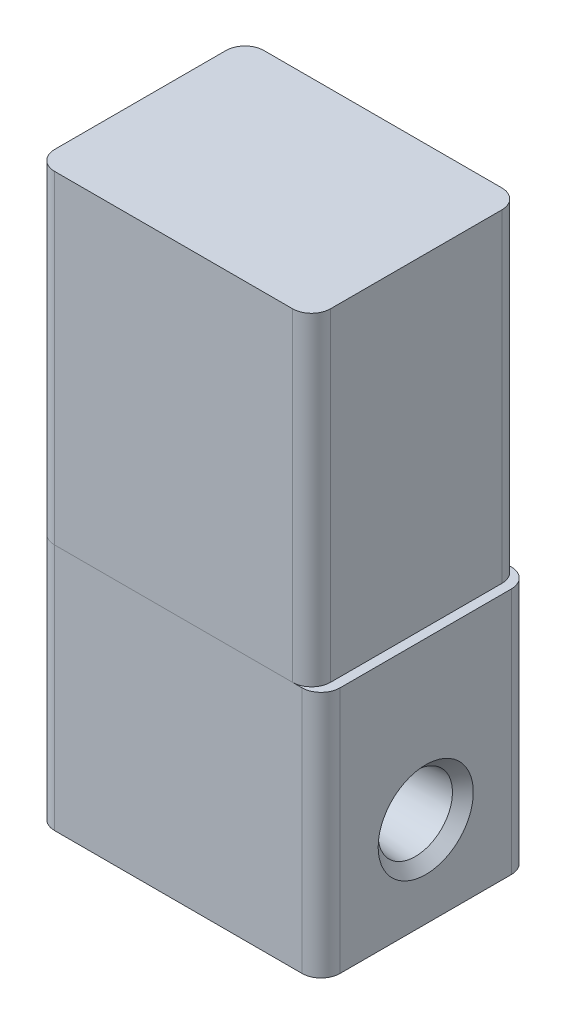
ISO-10303-21;
HEADER;
FILE_DESCRIPTION(('STEP AP214'),'2;1');
FILE_NAME('part.step','',(''),(''),'','','');
FILE_SCHEMA(('AUTOMOTIVE_DESIGN { 1 0 10303 214 1 1 1 1 }'));
ENDSEC;
DATA;
#1=APPLICATION_CONTEXT('core data for automotive mechanical design processes');
#2=APPLICATION_PROTOCOL_DEFINITION('international standard','automotive_design',2000,#1);
#3=PRODUCT_CONTEXT('',#1,'mechanical');
#4=PRODUCT('Part','Part','',(#3));
#5=PRODUCT_RELATED_PRODUCT_CATEGORY('part','',(#4));
#6=PRODUCT_DEFINITION_FORMATION('','',#4);
#7=PRODUCT_DEFINITION_CONTEXT('part definition',#1,'design');
#8=PRODUCT_DEFINITION('design','',#6,#7);
#9=PRODUCT_DEFINITION_SHAPE('','',#8);
#10=(LENGTH_UNIT() NAMED_UNIT(*) SI_UNIT(.MILLI.,.METRE.));
#11=(NAMED_UNIT(*) PLANE_ANGLE_UNIT() SI_UNIT($,.RADIAN.));
#12=(NAMED_UNIT(*) SI_UNIT($,.STERADIAN.) SOLID_ANGLE_UNIT());
#13=UNCERTAINTY_MEASURE_WITH_UNIT(LENGTH_MEASURE(1.E-05),#10,'distance_accuracy_value','');
#14=(GEOMETRIC_REPRESENTATION_CONTEXT(3) GLOBAL_UNCERTAINTY_ASSIGNED_CONTEXT((#13)) GLOBAL_UNIT_ASSIGNED_CONTEXT((#10,
#11,#12)) REPRESENTATION_CONTEXT('',''));
#15=CARTESIAN_POINT('',(0.,0.,0.));
#16=DIRECTION('',(0.,0.,1.));
#17=DIRECTION('',(1.,0.,0.));
#18=AXIS2_PLACEMENT_3D('',#15,#16,#17);
#19=CARTESIAN_POINT('',(-15.,60.,11.));
#20=DIRECTION('',(1.,0.,0.));
#21=DIRECTION('',(0.,0.,-1.));
#22=AXIS2_PLACEMENT_3D('',#19,#20,#21);
#23=PLANE('',#22);
#24=DIRECTION('',(0.,0.,1.));
#25=VECTOR('',#24,1.);
#26=CARTESIAN_POINT('',(-15.,60.,11.));
#27=LINE('',#26,#25);
#28=CARTESIAN_POINT('',(-15.,60.,-9.));
#29=VERTEX_POINT('',#28);
#30=CARTESIAN_POINT('',(-15.,60.,9.));
#31=VERTEX_POINT('',#30);
#32=EDGE_CURVE('E133',#29,#31,#27,.T.);
#33=ORIENTED_EDGE('',*,*,#32,.F.);
#34=DIRECTION('',(0.,-1.,0.));
#35=VECTOR('',#34,1.);
#36=CARTESIAN_POINT('',(-15.,60.,-9.));
#37=LINE('',#36,#35);
#38=CARTESIAN_POINT('',(-15.,26.,-9.));
#39=VERTEX_POINT('',#38);
#40=EDGE_CURVE('E118',#29,#39,#37,.T.);
#41=ORIENTED_EDGE('',*,*,#40,.T.);
#42=DIRECTION('',(0.,0.,1.));
#43=VECTOR('',#42,1.);
#44=CARTESIAN_POINT('',(-15.,26.,11.));
#45=LINE('',#44,#43);
#46=CARTESIAN_POINT('',(-15.,26.,9.));
#47=VERTEX_POINT('',#46);
#48=EDGE_CURVE('E130',#39,#47,#45,.T.);
#49=ORIENTED_EDGE('',*,*,#48,.T.);
#50=DIRECTION('',(0.,-1.,0.));
#51=VECTOR('',#50,1.);
#52=CARTESIAN_POINT('',(-15.,60.,9.));
#53=LINE('',#52,#51);
#54=EDGE_CURVE('E135',#47,#31,#53,.F.);
#55=ORIENTED_EDGE('',*,*,#54,.T.);
#56=EDGE_LOOP('',(#33,#41,#49,#55));
#57=FACE_BOUND('',#56,.T.);
#58=ADVANCED_FACE('F49',(#57),#23,.F.);
#59=CARTESIAN_POINT('',(14.,60.,11.));
#60=DIRECTION('',(0.,0.,-1.));
#61=DIRECTION('',(-1.,0.,0.));
#62=AXIS2_PLACEMENT_3D('',#59,#60,#61);
#63=PLANE('',#62);
#64=DIRECTION('',(1.,0.,0.));
#65=VECTOR('',#64,1.);
#66=CARTESIAN_POINT('',(14.,60.,11.));
#67=LINE('',#66,#65);
#68=CARTESIAN_POINT('',(-13.,60.,11.));
#69=VERTEX_POINT('',#68);
#70=CARTESIAN_POINT('',(12.,60.,11.));
#71=VERTEX_POINT('',#70);
#72=EDGE_CURVE('E184',#69,#71,#67,.T.);
#73=ORIENTED_EDGE('',*,*,#72,.F.);
#74=DIRECTION('',(0.,-1.,0.));
#75=VECTOR('',#74,1.);
#76=CARTESIAN_POINT('',(-13.,60.,11.));
#77=LINE('',#76,#75);
#78=CARTESIAN_POINT('',(-13.,26.,11.));
#79=VERTEX_POINT('',#78);
#80=EDGE_CURVE('E168',#69,#79,#77,.T.);
#81=ORIENTED_EDGE('',*,*,#80,.T.);
#82=DIRECTION('',(1.,0.,0.));
#83=VECTOR('',#82,1.);
#84=CARTESIAN_POINT('',(14.,26.,11.));
#85=LINE('',#84,#83);
#86=CARTESIAN_POINT('',(12.,26.,11.));
#87=VERTEX_POINT('',#86);
#88=EDGE_CURVE('E139',#79,#87,#85,.T.);
#89=ORIENTED_EDGE('',*,*,#88,.T.);
#90=DIRECTION('',(0.,-1.,0.));
#91=VECTOR('',#90,1.);
#92=CARTESIAN_POINT('',(12.,60.,11.));
#93=LINE('',#92,#91);
#94=EDGE_CURVE('E166',#87,#71,#93,.F.);
#95=ORIENTED_EDGE('',*,*,#94,.T.);
#96=EDGE_LOOP('',(#73,#81,#89,#95));
#97=FACE_BOUND('',#96,.T.);
#98=ADVANCED_FACE('F194',(#97),#63,.F.);
#99=CARTESIAN_POINT('',(14.,60.,11.));
#100=DIRECTION('',(-1.,0.,0.));
#101=DIRECTION('',(0.,0.,1.));
#102=AXIS2_PLACEMENT_3D('',#99,#100,#101);
#103=PLANE('',#102);
#104=DIRECTION('',(0.,0.,-1.));
#105=VECTOR('',#104,1.);
#106=CARTESIAN_POINT('',(14.,26.,11.));
#107=LINE('',#106,#105);
#108=CARTESIAN_POINT('',(14.,26.,9.));
#109=VERTEX_POINT('',#108);
#110=CARTESIAN_POINT('',(14.,26.,-9.));
#111=VERTEX_POINT('',#110);
#112=EDGE_CURVE('E142',#109,#111,#107,.T.);
#113=ORIENTED_EDGE('',*,*,#112,.T.);
#114=DIRECTION('',(0.,-1.,0.));
#115=VECTOR('',#114,1.);
#116=CARTESIAN_POINT('',(14.,60.,-9.));
#117=LINE('',#116,#115);
#118=CARTESIAN_POINT('',(14.,60.,-9.));
#119=VERTEX_POINT('',#118);
#120=EDGE_CURVE('E12',#111,#119,#117,.F.);
#121=ORIENTED_EDGE('',*,*,#120,.T.);
#122=DIRECTION('',(0.,0.,-1.));
#123=VECTOR('',#122,1.);
#124=CARTESIAN_POINT('',(14.,60.,11.));
#125=LINE('',#124,#123);
#126=CARTESIAN_POINT('',(14.,60.,9.));
#127=VERTEX_POINT('',#126);
#128=EDGE_CURVE('E174',#127,#119,#125,.T.);
#129=ORIENTED_EDGE('',*,*,#128,.F.);
#130=DIRECTION('',(0.,-1.,0.));
#131=VECTOR('',#130,1.);
#132=CARTESIAN_POINT('',(14.,60.,9.));
#133=LINE('',#132,#131);
#134=EDGE_CURVE('E57',#127,#109,#133,.T.);
#135=ORIENTED_EDGE('',*,*,#134,.T.);
#136=EDGE_LOOP('',(#113,#121,#129,#135));
#137=FACE_BOUND('',#136,.T.);
#138=ADVANCED_FACE('F173',(#137),#103,.F.);
#139=CARTESIAN_POINT('',(14.,60.,-11.));
#140=DIRECTION('',(0.,0.,1.));
#141=DIRECTION('',(1.,0.,0.));
#142=AXIS2_PLACEMENT_3D('',#139,#140,#141);
#143=PLANE('',#142);
#144=DIRECTION('',(-1.,0.,0.));
#145=VECTOR('',#144,1.);
#146=CARTESIAN_POINT('',(14.,26.,-11.));
#147=LINE('',#146,#145);
#148=CARTESIAN_POINT('',(12.,26.,-11.));
#149=VERTEX_POINT('',#148);
#150=CARTESIAN_POINT('',(-13.,26.,-11.));
#151=VERTEX_POINT('',#150);
#152=EDGE_CURVE('E149',#149,#151,#147,.T.);
#153=ORIENTED_EDGE('',*,*,#152,.T.);
#154=DIRECTION('',(0.,-1.,0.));
#155=VECTOR('',#154,1.);
#156=CARTESIAN_POINT('',(-13.,60.,-11.));
#157=LINE('',#156,#155);
#158=CARTESIAN_POINT('',(-13.,60.,-11.));
#159=VERTEX_POINT('',#158);
#160=EDGE_CURVE('E119',#151,#159,#157,.F.);
#161=ORIENTED_EDGE('',*,*,#160,.T.);
#162=DIRECTION('',(-1.,0.,0.));
#163=VECTOR('',#162,1.);
#164=CARTESIAN_POINT('',(14.,60.,-11.));
#165=LINE('',#164,#163);
#166=CARTESIAN_POINT('',(12.,60.,-11.));
#167=VERTEX_POINT('',#166);
#168=EDGE_CURVE('E145',#167,#159,#165,.T.);
#169=ORIENTED_EDGE('',*,*,#168,.F.);
#170=DIRECTION('',(0.,-1.,0.));
#171=VECTOR('',#170,1.);
#172=CARTESIAN_POINT('',(12.,60.,-11.));
#173=LINE('',#172,#171);
#174=EDGE_CURVE('E124',#167,#149,#173,.T.);
#175=ORIENTED_EDGE('',*,*,#174,.T.);
#176=EDGE_LOOP('',(#153,#161,#169,#175));
#177=FACE_BOUND('',#176,.T.);
#178=ADVANCED_FACE('F182',(#177),#143,.F.);
#179=CARTESIAN_POINT('',(0.,60.,0.));
#180=DIRECTION('',(0.,1.,0.));
#181=DIRECTION('',(0.,0.,1.));
#182=AXIS2_PLACEMENT_3D('',#179,#180,#181);
#183=PLANE('',#182);
#184=ORIENTED_EDGE('',*,*,#168,.T.);
#185=CARTESIAN_POINT('',(-13.,60.,-9.));
#186=DIRECTION('',(0.,1.,0.));
#187=DIRECTION('',(0.,0.,1.));
#188=AXIS2_PLACEMENT_3D('',#185,#186,#187);
#189=CIRCLE('',#188,2.);
#190=EDGE_CURVE('E164',#159,#29,#189,.T.);
#191=ORIENTED_EDGE('',*,*,#190,.T.);
#192=ORIENTED_EDGE('',*,*,#32,.T.);
#193=CARTESIAN_POINT('',(-13.,60.,9.));
#194=DIRECTION('',(0.,1.,0.));
#195=DIRECTION('',(0.,0.,1.));
#196=AXIS2_PLACEMENT_3D('',#193,#194,#195);
#197=CIRCLE('',#196,2.);
#198=EDGE_CURVE('E162',#31,#69,#197,.T.);
#199=ORIENTED_EDGE('',*,*,#198,.T.);
#200=ORIENTED_EDGE('',*,*,#72,.T.);
#201=CARTESIAN_POINT('',(12.,60.,9.));
#202=DIRECTION('',(0.,1.,0.));
#203=DIRECTION('',(0.,0.,1.));
#204=AXIS2_PLACEMENT_3D('',#201,#202,#203);
#205=CIRCLE('',#204,2.);
#206=EDGE_CURVE('E69',#71,#127,#205,.T.);
#207=ORIENTED_EDGE('',*,*,#206,.T.);
#208=ORIENTED_EDGE('',*,*,#128,.T.);
#209=CARTESIAN_POINT('',(12.,60.,-9.));
#210=DIRECTION('',(0.,1.,0.));
#211=DIRECTION('',(0.,0.,1.));
#212=AXIS2_PLACEMENT_3D('',#209,#210,#211);
#213=CIRCLE('',#212,2.);
#214=EDGE_CURVE('E160',#119,#167,#213,.T.);
#215=ORIENTED_EDGE('',*,*,#214,.T.);
#216=EDGE_LOOP('',(#184,#191,#192,#199,#200,#207,#208,#215));
#217=FACE_BOUND('',#216,.T.);
#218=ADVANCED_FACE('F188',(#217),#183,.T.);
#219=CARTESIAN_POINT('',(0.,26.,0.));
#220=DIRECTION('',(0.,1.,0.));
#221=DIRECTION('',(0.,0.,1.));
#222=AXIS2_PLACEMENT_3D('',#219,#220,#221);
#223=PLANE('',#222);
#224=ORIENTED_EDGE('',*,*,#48,.F.);
#225=CARTESIAN_POINT('',(-13.,26.,-9.));
#226=DIRECTION('',(0.,1.,0.));
#227=DIRECTION('',(0.,0.,1.));
#228=AXIS2_PLACEMENT_3D('',#225,#226,#227);
#229=CIRCLE('',#228,2.);
#230=EDGE_CURVE('E114',#39,#151,#229,.F.);
#231=ORIENTED_EDGE('',*,*,#230,.T.);
#232=ORIENTED_EDGE('',*,*,#152,.F.);
#233=CARTESIAN_POINT('',(12.,26.,-9.));
#234=DIRECTION('',(0.,1.,0.));
#235=DIRECTION('',(0.,0.,1.));
#236=AXIS2_PLACEMENT_3D('',#233,#234,#235);
#237=CIRCLE('',#236,2.);
#238=EDGE_CURVE('E153',#149,#111,#237,.F.);
#239=ORIENTED_EDGE('',*,*,#238,.T.);
#240=ORIENTED_EDGE('',*,*,#112,.F.);
#241=CARTESIAN_POINT('',(12.,26.,9.));
#242=DIRECTION('',(0.,1.,0.));
#243=DIRECTION('',(0.,0.,1.));
#244=AXIS2_PLACEMENT_3D('',#241,#242,#243);
#245=CIRCLE('',#244,2.);
#246=EDGE_CURVE('E134',#109,#87,#245,.F.);
#247=ORIENTED_EDGE('',*,*,#246,.T.);
#248=ORIENTED_EDGE('',*,*,#88,.F.);
#249=CARTESIAN_POINT('',(-13.,26.,9.));
#250=DIRECTION('',(0.,1.,0.));
#251=DIRECTION('',(0.,0.,1.));
#252=AXIS2_PLACEMENT_3D('',#249,#250,#251);
#253=CIRCLE('',#252,2.);
#254=EDGE_CURVE('E125',#79,#47,#253,.F.);
#255=ORIENTED_EDGE('',*,*,#254,.T.);
#256=EDGE_LOOP('',(#224,#231,#232,#239,#240,#247,#248,#255));
#257=FACE_BOUND('',#256,.T.);
#258=ADVANCED_FACE('F137',(#257),#223,.F.);
#259=CARTESIAN_POINT('',(-13.,60.,-9.));
#260=DIRECTION('',(0.,-1.,0.));
#261=DIRECTION('',(0.,0.,-1.));
#262=AXIS2_PLACEMENT_3D('',#259,#260,#261);
#263=CYLINDRICAL_SURFACE('',#262,2.);
#264=ORIENTED_EDGE('',*,*,#190,.F.);
#265=ORIENTED_EDGE('',*,*,#160,.F.);
#266=ORIENTED_EDGE('',*,*,#230,.F.);
#267=ORIENTED_EDGE('',*,*,#40,.F.);
#268=EDGE_LOOP('',(#264,#265,#266,#267));
#269=FACE_BOUND('',#268,.T.);
#270=ADVANCED_FACE('F117',(#269),#263,.T.);
#271=CARTESIAN_POINT('',(-13.,60.,9.));
#272=DIRECTION('',(0.,-1.,0.));
#273=DIRECTION('',(0.,0.,-1.));
#274=AXIS2_PLACEMENT_3D('',#271,#272,#273);
#275=CYLINDRICAL_SURFACE('',#274,2.);
#276=ORIENTED_EDGE('',*,*,#198,.F.);
#277=ORIENTED_EDGE('',*,*,#54,.F.);
#278=ORIENTED_EDGE('',*,*,#254,.F.);
#279=ORIENTED_EDGE('',*,*,#80,.F.);
#280=EDGE_LOOP('',(#276,#277,#278,#279));
#281=FACE_BOUND('',#280,.T.);
#282=ADVANCED_FACE('F192',(#281),#275,.T.);
#283=CARTESIAN_POINT('',(12.,60.,-9.));
#284=DIRECTION('',(0.,-1.,0.));
#285=DIRECTION('',(0.,0.,-1.));
#286=AXIS2_PLACEMENT_3D('',#283,#284,#285);
#287=CYLINDRICAL_SURFACE('',#286,2.);
#288=ORIENTED_EDGE('',*,*,#214,.F.);
#289=ORIENTED_EDGE('',*,*,#120,.F.);
#290=ORIENTED_EDGE('',*,*,#238,.F.);
#291=ORIENTED_EDGE('',*,*,#174,.F.);
#292=EDGE_LOOP('',(#288,#289,#290,#291));
#293=FACE_BOUND('',#292,.T.);
#294=ADVANCED_FACE('F179',(#293),#287,.T.);
#295=CARTESIAN_POINT('',(12.,60.,9.));
#296=DIRECTION('',(0.,-1.,0.));
#297=DIRECTION('',(0.,0.,-1.));
#298=AXIS2_PLACEMENT_3D('',#295,#296,#297);
#299=CYLINDRICAL_SURFACE('',#298,2.);
#300=ORIENTED_EDGE('',*,*,#206,.F.);
#301=ORIENTED_EDGE('',*,*,#94,.F.);
#302=ORIENTED_EDGE('',*,*,#246,.F.);
#303=ORIENTED_EDGE('',*,*,#134,.F.);
#304=EDGE_LOOP('',(#300,#301,#302,#303));
#305=FACE_BOUND('',#304,.T.);
#306=ADVANCED_FACE('F51',(#305),#299,.T.);
#307=CLOSED_SHELL('',(#58,#98,#138,#178,#218,#258,#270,#282,#294,#306));
#308=MANIFOLD_SOLID_BREP('B2',#307);
#309=CARTESIAN_POINT('',(15.,26.,11.));
#310=DIRECTION('',(-1.,0.,0.));
#311=DIRECTION('',(0.,0.,1.));
#312=AXIS2_PLACEMENT_3D('',#309,#310,#311);
#313=PLANE('',#312);
#314=CARTESIAN_POINT('',(15.,9.5,0.));
#315=DIRECTION('',(-1.,0.,0.));
#316=DIRECTION('',(0.,0.,1.));
#317=AXIS2_PLACEMENT_3D('',#314,#315,#316);
#318=CIRCLE('',#317,5.00000000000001);
#319=CARTESIAN_POINT('',(15.,9.5,5.00000000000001));
#320=VERTEX_POINT('',#319);
#321=EDGE_CURVE('E395',#320,#320,#318,.T.);
#322=ORIENTED_EDGE('',*,*,#321,.T.);
#323=EDGE_LOOP('',(#322));
#324=FACE_BOUND('',#323,.T.);
#325=DIRECTION('',(0.,0.,-1.));
#326=VECTOR('',#325,1.);
#327=CARTESIAN_POINT('',(15.,0.,11.));
#328=LINE('',#327,#326);
#329=CARTESIAN_POINT('',(15.,0.,9.));
#330=VERTEX_POINT('',#329);
#331=CARTESIAN_POINT('',(15.,0.,-9.));
#332=VERTEX_POINT('',#331);
#333=EDGE_CURVE('E372',#330,#332,#328,.T.);
#334=ORIENTED_EDGE('',*,*,#333,.T.);
#335=DIRECTION('',(0.,-1.,0.));
#336=VECTOR('',#335,1.);
#337=CARTESIAN_POINT('',(15.,26.,-9.));
#338=LINE('',#337,#336);
#339=CARTESIAN_POINT('',(15.,26.,-9.));
#340=VERTEX_POINT('',#339);
#341=EDGE_CURVE('E47',#332,#340,#338,.F.);
#342=ORIENTED_EDGE('',*,*,#341,.T.);
#343=DIRECTION('',(0.,0.,-1.));
#344=VECTOR('',#343,1.);
#345=CARTESIAN_POINT('',(15.,26.,11.));
#346=LINE('',#345,#344);
#347=CARTESIAN_POINT('',(15.,26.,9.));
#348=VERTEX_POINT('',#347);
#349=EDGE_CURVE('E370',#348,#340,#346,.T.);
#350=ORIENTED_EDGE('',*,*,#349,.F.);
#351=DIRECTION('',(0.,-1.,0.));
#352=VECTOR('',#351,1.);
#353=CARTESIAN_POINT('',(15.,26.,9.));
#354=LINE('',#353,#352);
#355=EDGE_CURVE('E284',#348,#330,#354,.T.);
#356=ORIENTED_EDGE('',*,*,#355,.T.);
#357=EDGE_LOOP('',(#334,#342,#350,#356));
#358=FACE_BOUND('',#357,.T.);
#359=ADVANCED_FACE('F276',(#324,#358),#313,.F.);
#360=CARTESIAN_POINT('',(-15.,26.,-11.));
#361=DIRECTION('',(0.,0.,1.));
#362=DIRECTION('',(1.,0.,0.));
#363=AXIS2_PLACEMENT_3D('',#360,#361,#362);
#364=PLANE('',#363);
#365=DIRECTION('',(-1.,0.,0.));
#366=VECTOR('',#365,1.);
#367=CARTESIAN_POINT('',(-15.,0.,-11.));
#368=LINE('',#367,#366);
#369=CARTESIAN_POINT('',(13.,0.,-11.));
#370=VERTEX_POINT('',#369);
#371=CARTESIAN_POINT('',(-13.,0.,-11.));
#372=VERTEX_POINT('',#371);
#373=EDGE_CURVE('E368',#370,#372,#368,.T.);
#374=ORIENTED_EDGE('',*,*,#373,.T.);
#375=DIRECTION('',(0.,-1.,0.));
#376=VECTOR('',#375,1.);
#377=CARTESIAN_POINT('',(-13.,26.,-11.));
#378=LINE('',#377,#376);
#379=CARTESIAN_POINT('',(-13.,26.,-11.));
#380=VERTEX_POINT('',#379);
#381=EDGE_CURVE('E347',#372,#380,#378,.F.);
#382=ORIENTED_EDGE('',*,*,#381,.T.);
#383=DIRECTION('',(-1.,0.,0.));
#384=VECTOR('',#383,1.);
#385=CARTESIAN_POINT('',(-15.,26.,-11.));
#386=LINE('',#385,#384);
#387=CARTESIAN_POINT('',(13.,26.,-11.));
#388=VERTEX_POINT('',#387);
#389=EDGE_CURVE('E436',#388,#380,#386,.T.);
#390=ORIENTED_EDGE('',*,*,#389,.F.);
#391=DIRECTION('',(0.,-1.,0.));
#392=VECTOR('',#391,1.);
#393=CARTESIAN_POINT('',(13.,26.,-11.));
#394=LINE('',#393,#392);
#395=EDGE_CURVE('E352',#388,#370,#394,.T.);
#396=ORIENTED_EDGE('',*,*,#395,.T.);
#397=EDGE_LOOP('',(#374,#382,#390,#396));
#398=FACE_BOUND('',#397,.T.);
#399=ADVANCED_FACE('F470',(#398),#364,.F.);
#400=CARTESIAN_POINT('',(-15.,26.,11.));
#401=DIRECTION('',(1.,0.,0.));
#402=DIRECTION('',(0.,0.,-1.));
#403=AXIS2_PLACEMENT_3D('',#400,#401,#402);
#404=PLANE('',#403);
#405=CARTESIAN_POINT('',(-15.,9.5,0.));
#406=DIRECTION('',(1.,0.,0.));
#407=DIRECTION('',(0.,0.,-1.));
#408=AXIS2_PLACEMENT_3D('',#405,#406,#407);
#409=CIRCLE('',#408,5.10006286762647);
#410=CARTESIAN_POINT('',(-15.,9.5,-5.10006286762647));
#411=VERTEX_POINT('',#410);
#412=EDGE_CURVE('E376',#411,#411,#409,.T.);
#413=ORIENTED_EDGE('',*,*,#412,.T.);
#414=EDGE_LOOP('',(#413));
#415=FACE_BOUND('',#414,.T.);
#416=DIRECTION('',(0.,0.,1.));
#417=VECTOR('',#416,1.);
#418=CARTESIAN_POINT('',(-15.,26.,11.));
#419=LINE('',#418,#417);
#420=CARTESIAN_POINT('',(-15.,26.,-9.));
#421=VERTEX_POINT('',#420);
#422=CARTESIAN_POINT('',(-15.,26.,9.));
#423=VERTEX_POINT('',#422);
#424=EDGE_CURVE('E361',#421,#423,#419,.T.);
#425=ORIENTED_EDGE('',*,*,#424,.F.);
#426=DIRECTION('',(0.,-1.,0.));
#427=VECTOR('',#426,1.);
#428=CARTESIAN_POINT('',(-15.,26.,-9.));
#429=LINE('',#428,#427);
#430=CARTESIAN_POINT('',(-15.,0.,-9.));
#431=VERTEX_POINT('',#430);
#432=EDGE_CURVE('E346',#421,#431,#429,.T.);
#433=ORIENTED_EDGE('',*,*,#432,.T.);
#434=DIRECTION('',(0.,0.,1.));
#435=VECTOR('',#434,1.);
#436=CARTESIAN_POINT('',(-15.,0.,11.));
#437=LINE('',#436,#435);
#438=CARTESIAN_POINT('',(-15.,0.,9.));
#439=VERTEX_POINT('',#438);
#440=EDGE_CURVE('E359',#431,#439,#437,.T.);
#441=ORIENTED_EDGE('',*,*,#440,.T.);
#442=DIRECTION('',(0.,-1.,0.));
#443=VECTOR('',#442,1.);
#444=CARTESIAN_POINT('',(-15.,26.,9.));
#445=LINE('',#444,#443);
#446=EDGE_CURVE('E363',#439,#423,#445,.F.);
#447=ORIENTED_EDGE('',*,*,#446,.T.);
#448=EDGE_LOOP('',(#425,#433,#441,#447));
#449=FACE_BOUND('',#448,.T.);
#450=ADVANCED_FACE('F358',(#415,#449),#404,.F.);
#451=CARTESIAN_POINT('',(-15.,26.,11.));
#452=DIRECTION('',(0.,0.,-1.));
#453=DIRECTION('',(-1.,0.,0.));
#454=AXIS2_PLACEMENT_3D('',#451,#452,#453);
#455=PLANE('',#454);
#456=DIRECTION('',(1.,0.,0.));
#457=VECTOR('',#456,1.);
#458=CARTESIAN_POINT('',(-15.,26.,11.));
#459=LINE('',#458,#457);
#460=CARTESIAN_POINT('',(-13.,26.,11.));
#461=VERTEX_POINT('',#460);
#462=CARTESIAN_POINT('',(13.,26.,11.));
#463=VERTEX_POINT('',#462);
#464=EDGE_CURVE('E380',#461,#463,#459,.T.);
#465=ORIENTED_EDGE('',*,*,#464,.F.);
#466=DIRECTION('',(0.,-1.,0.));
#467=VECTOR('',#466,1.);
#468=CARTESIAN_POINT('',(-13.,26.,11.));
#469=LINE('',#468,#467);
#470=CARTESIAN_POINT('',(-13.,0.,11.));
#471=VERTEX_POINT('',#470);
#472=EDGE_CURVE('E417',#461,#471,#469,.T.);
#473=ORIENTED_EDGE('',*,*,#472,.T.);
#474=DIRECTION('',(1.,0.,0.));
#475=VECTOR('',#474,1.);
#476=CARTESIAN_POINT('',(-15.,0.,11.));
#477=LINE('',#476,#475);
#478=CARTESIAN_POINT('',(13.,0.,11.));
#479=VERTEX_POINT('',#478);
#480=EDGE_CURVE('E367',#471,#479,#477,.T.);
#481=ORIENTED_EDGE('',*,*,#480,.T.);
#482=DIRECTION('',(0.,-1.,0.));
#483=VECTOR('',#482,1.);
#484=CARTESIAN_POINT('',(13.,26.,11.));
#485=LINE('',#484,#483);
#486=EDGE_CURVE('E291',#479,#463,#485,.F.);
#487=ORIENTED_EDGE('',*,*,#486,.T.);
#488=EDGE_LOOP('',(#465,#473,#481,#487));
#489=FACE_BOUND('',#488,.T.);
#490=ADVANCED_FACE('F524',(#489),#455,.F.);
#491=CARTESIAN_POINT('',(0.,26.,0.));
#492=DIRECTION('',(0.,-1.,0.));
#493=DIRECTION('',(0.,0.,-1.));
#494=AXIS2_PLACEMENT_3D('',#491,#492,#493);
#495=PLANE('',#494);
#496=ORIENTED_EDGE('',*,*,#389,.T.);
#497=CARTESIAN_POINT('',(-13.,26.,-9.));
#498=DIRECTION('',(0.,-1.,0.));
#499=DIRECTION('',(0.,0.,-1.));
#500=AXIS2_PLACEMENT_3D('',#497,#498,#499);
#501=CIRCLE('',#500,2.);
#502=EDGE_CURVE('E414',#380,#421,#501,.F.);
#503=ORIENTED_EDGE('',*,*,#502,.T.);
#504=ORIENTED_EDGE('',*,*,#424,.T.);
#505=CARTESIAN_POINT('',(-13.,26.,9.));
#506=DIRECTION('',(0.,-1.,0.));
#507=DIRECTION('',(0.,0.,-1.));
#508=AXIS2_PLACEMENT_3D('',#505,#506,#507);
#509=CIRCLE('',#508,2.);
#510=EDGE_CURVE('E298',#423,#461,#509,.F.);
#511=ORIENTED_EDGE('',*,*,#510,.T.);
#512=ORIENTED_EDGE('',*,*,#464,.T.);
#513=CARTESIAN_POINT('',(13.,26.,9.));
#514=DIRECTION('',(0.,-1.,0.));
#515=DIRECTION('',(0.,0.,-1.));
#516=AXIS2_PLACEMENT_3D('',#513,#514,#515);
#517=CIRCLE('',#516,2.);
#518=EDGE_CURVE('E409',#463,#348,#517,.F.);
#519=ORIENTED_EDGE('',*,*,#518,.T.);
#520=ORIENTED_EDGE('',*,*,#349,.T.);
#521=CARTESIAN_POINT('',(13.,26.,-9.));
#522=DIRECTION('',(0.,-1.,0.));
#523=DIRECTION('',(0.,0.,-1.));
#524=AXIS2_PLACEMENT_3D('',#521,#522,#523);
#525=CIRCLE('',#524,2.);
#526=EDGE_CURVE('E411',#340,#388,#525,.F.);
#527=ORIENTED_EDGE('',*,*,#526,.T.);
#528=EDGE_LOOP('',(#496,#503,#504,#511,#512,#519,#520,#527));
#529=FACE_BOUND('',#528,.T.);
#530=ADVANCED_FACE('F454',(#529),#495,.F.);
#531=CARTESIAN_POINT('',(0.,0.,0.));
#532=DIRECTION('',(0.,-1.,0.));
#533=DIRECTION('',(0.,0.,-1.));
#534=AXIS2_PLACEMENT_3D('',#531,#532,#533);
#535=PLANE('',#534);
#536=CARTESIAN_POINT('',(10.,0.,7.5));
#537=DIRECTION('',(0.,-1.,0.));
#538=DIRECTION('',(0.,0.,-1.));
#539=AXIS2_PLACEMENT_3D('',#536,#537,#538);
#540=CIRCLE('',#539,2.);
#541=CARTESIAN_POINT('',(10.,0.,5.5));
#542=VERTEX_POINT('',#541);
#543=EDGE_CURVE('E431',#542,#542,#540,.T.);
#544=ORIENTED_EDGE('',*,*,#543,.F.);
#545=EDGE_LOOP('',(#544));
#546=FACE_BOUND('',#545,.T.);
#547=CARTESIAN_POINT('',(10.,0.,-7.5));
#548=DIRECTION('',(0.,-1.,0.));
#549=DIRECTION('',(0.,0.,-1.));
#550=AXIS2_PLACEMENT_3D('',#547,#548,#549);
#551=CIRCLE('',#550,2.);
#552=CARTESIAN_POINT('',(10.,0.,-9.5));
#553=VERTEX_POINT('',#552);
#554=EDGE_CURVE('E440',#553,#553,#551,.T.);
#555=ORIENTED_EDGE('',*,*,#554,.F.);
#556=EDGE_LOOP('',(#555));
#557=FACE_BOUND('',#556,.T.);
#558=ORIENTED_EDGE('',*,*,#440,.F.);
#559=CARTESIAN_POINT('',(-13.,0.,-9.));
#560=DIRECTION('',(0.,-1.,0.));
#561=DIRECTION('',(0.,0.,-1.));
#562=AXIS2_PLACEMENT_3D('',#559,#560,#561);
#563=CIRCLE('',#562,2.);
#564=EDGE_CURVE('E342',#431,#372,#563,.T.);
#565=ORIENTED_EDGE('',*,*,#564,.T.);
#566=ORIENTED_EDGE('',*,*,#373,.F.);
#567=CARTESIAN_POINT('',(13.,0.,-9.));
#568=DIRECTION('',(0.,-1.,0.));
#569=DIRECTION('',(0.,0.,-1.));
#570=AXIS2_PLACEMENT_3D('',#567,#568,#569);
#571=CIRCLE('',#570,2.);
#572=EDGE_CURVE('E403',#370,#332,#571,.T.);
#573=ORIENTED_EDGE('',*,*,#572,.T.);
#574=ORIENTED_EDGE('',*,*,#333,.F.);
#575=CARTESIAN_POINT('',(13.,0.,9.));
#576=DIRECTION('',(0.,-1.,0.));
#577=DIRECTION('',(0.,0.,-1.));
#578=AXIS2_PLACEMENT_3D('',#575,#576,#577);
#579=CIRCLE('',#578,2.);
#580=EDGE_CURVE('E362',#330,#479,#579,.T.);
#581=ORIENTED_EDGE('',*,*,#580,.T.);
#582=ORIENTED_EDGE('',*,*,#480,.F.);
#583=CARTESIAN_POINT('',(-13.,0.,9.));
#584=DIRECTION('',(0.,-1.,0.));
#585=DIRECTION('',(0.,0.,-1.));
#586=AXIS2_PLACEMENT_3D('',#583,#584,#585);
#587=CIRCLE('',#586,2.);
#588=EDGE_CURVE('E353',#471,#439,#587,.T.);
#589=ORIENTED_EDGE('',*,*,#588,.T.);
#590=EDGE_LOOP('',(#558,#565,#566,#573,#574,#581,#582,#589));
#591=FACE_BOUND('',#590,.T.);
#592=ADVANCED_FACE('F365',(#546,#557,#591),#535,.T.);
#593=CARTESIAN_POINT('',(10.,4.,-7.5));
#594=DIRECTION('',(0.,-1.,0.));
#595=DIRECTION('',(0.,0.,-1.));
#596=AXIS2_PLACEMENT_3D('',#593,#594,#595);
#597=CYLINDRICAL_SURFACE('',#596,2.);
#598=CARTESIAN_POINT('',(10.,4.,-7.5));
#599=DIRECTION('',(0.,-1.,0.));
#600=DIRECTION('',(0.,0.,-1.));
#601=AXIS2_PLACEMENT_3D('',#598,#599,#600);
#602=CIRCLE('',#601,2.);
#603=CARTESIAN_POINT('',(10.,4.,-9.5));
#604=VERTEX_POINT('',#603);
#605=EDGE_CURVE('E443',#604,#604,#602,.T.);
#606=ORIENTED_EDGE('',*,*,#605,.F.);
#607=EDGE_LOOP('',(#606));
#608=FACE_BOUND('',#607,.T.);
#609=ORIENTED_EDGE('',*,*,#554,.T.);
#610=EDGE_LOOP('',(#609));
#611=FACE_BOUND('',#610,.T.);
#612=ADVANCED_FACE('F453',(#608,#611),#597,.F.);
#613=CARTESIAN_POINT('',(10.,4.,-7.5));
#614=DIRECTION('',(0.,-1.,0.));
#615=DIRECTION('',(0.,0.,-1.));
#616=AXIS2_PLACEMENT_3D('',#613,#614,#615);
#617=PLANE('',#616);
#618=ORIENTED_EDGE('',*,*,#605,.T.);
#619=EDGE_LOOP('',(#618));
#620=FACE_BOUND('',#619,.T.);
#621=ADVANCED_FACE('F459',(#620),#617,.T.);
#622=CARTESIAN_POINT('',(10.,4.,7.5));
#623=DIRECTION('',(0.,-1.,0.));
#624=DIRECTION('',(0.,0.,-1.));
#625=AXIS2_PLACEMENT_3D('',#622,#623,#624);
#626=CYLINDRICAL_SURFACE('',#625,2.);
#627=CARTESIAN_POINT('',(10.,4.,7.5));
#628=DIRECTION('',(0.,-1.,0.));
#629=DIRECTION('',(0.,0.,-1.));
#630=AXIS2_PLACEMENT_3D('',#627,#628,#629);
#631=CIRCLE('',#630,2.);
#632=CARTESIAN_POINT('',(10.,4.,5.5));
#633=VERTEX_POINT('',#632);
#634=EDGE_CURVE('E429',#633,#633,#631,.T.);
#635=ORIENTED_EDGE('',*,*,#634,.F.);
#636=EDGE_LOOP('',(#635));
#637=FACE_BOUND('',#636,.T.);
#638=ORIENTED_EDGE('',*,*,#543,.T.);
#639=EDGE_LOOP('',(#638));
#640=FACE_BOUND('',#639,.T.);
#641=ADVANCED_FACE('F449',(#637,#640),#626,.F.);
#642=CARTESIAN_POINT('',(10.,4.,7.5));
#643=DIRECTION('',(0.,-1.,0.));
#644=DIRECTION('',(0.,0.,-1.));
#645=AXIS2_PLACEMENT_3D('',#642,#643,#644);
#646=PLANE('',#645);
#647=ORIENTED_EDGE('',*,*,#634,.T.);
#648=EDGE_LOOP('',(#647));
#649=FACE_BOUND('',#648,.T.);
#650=ADVANCED_FACE('F608',(#649),#646,.T.);
#651=CARTESIAN_POINT('',(15.,9.5,0.));
#652=DIRECTION('',(1.,0.,0.));
#653=DIRECTION('',(0.,0.,-1.));
#654=AXIS2_PLACEMENT_3D('',#651,#652,#653);
#655=CONICAL_SURFACE('',#654,4.,0.0872664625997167);
#656=CARTESIAN_POINT('',(13.9041232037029,9.5,0.));
#657=DIRECTION('',(-1.,0.,0.));
#658=DIRECTION('',(0.,0.,1.));
#659=AXIS2_PLACEMENT_3D('',#656,#657,#658);
#660=CIRCLE('',#659,3.90412320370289);
#661=CARTESIAN_POINT('',(13.9041232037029,9.5,3.90412320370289));
#662=VERTEX_POINT('',#661);
#663=EDGE_CURVE('E392',#662,#662,#660,.F.);
#664=ORIENTED_EDGE('',*,*,#663,.T.);
#665=EDGE_LOOP('',(#664));
#666=FACE_BOUND('',#665,.T.);
#667=CARTESIAN_POINT('',(5.99619469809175,9.5,0.));
#668=DIRECTION('',(-1.,0.,0.));
#669=DIRECTION('',(0.,0.,1.));
#670=AXIS2_PLACEMENT_3D('',#667,#668,#669);
#671=CIRCLE('',#670,3.21226910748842);
#672=CARTESIAN_POINT('',(5.99619469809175,9.5,3.21226910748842));
#673=VERTEX_POINT('',#672);
#674=EDGE_CURVE('E389',#673,#673,#671,.T.);
#675=ORIENTED_EDGE('',*,*,#674,.T.);
#676=EDGE_LOOP('',(#675));
#677=FACE_BOUND('',#676,.T.);
#678=ADVANCED_FACE('F598',(#666,#677),#655,.F.);
#679=CARTESIAN_POINT('',(5.,9.5,0.));
#680=DIRECTION('',(1.,0.,0.));
#681=DIRECTION('',(0.,0.,-1.));
#682=AXIS2_PLACEMENT_3D('',#679,#680,#681);
#683=PLANE('',#682);
#684=CARTESIAN_POINT('',(5.,9.5,0.));
#685=DIRECTION('',(1.,0.,0.));
#686=DIRECTION('',(0.,0.,-1.));
#687=AXIS2_PLACEMENT_3D('',#684,#685,#686);
#688=CIRCLE('',#687,2.02505049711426);
#689=CARTESIAN_POINT('',(5.,9.5,-2.02505049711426));
#690=VERTEX_POINT('',#689);
#691=EDGE_CURVE('E398',#690,#690,#688,.T.);
#692=ORIENTED_EDGE('',*,*,#691,.T.);
#693=EDGE_LOOP('',(#692));
#694=FACE_BOUND('',#693,.T.);
#695=ADVANCED_FACE('F588',(#694),#683,.T.);
#696=CARTESIAN_POINT('',(-15.,9.5,0.));
#697=DIRECTION('',(-1.,0.,0.));
#698=DIRECTION('',(0.,0.,-1.));
#699=AXIS2_PLACEMENT_3D('',#696,#697,#698);
#700=CONICAL_SURFACE('',#699,4.,0.0872664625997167);
#701=CARTESIAN_POINT('',(-14.0038053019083,9.5,0.));
#702=DIRECTION('',(-1.,0.,0.));
#703=DIRECTION('',(0.,0.,1.));
#704=AXIS2_PLACEMENT_3D('',#701,#702,#703);
#705=CIRCLE('',#704,3.91284425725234);
#706=CARTESIAN_POINT('',(-14.0038053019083,9.5,3.91284425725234));
#707=VERTEX_POINT('',#706);
#708=EDGE_CURVE('E383',#707,#707,#705,.T.);
#709=ORIENTED_EDGE('',*,*,#708,.T.);
#710=EDGE_LOOP('',(#709));
#711=FACE_BOUND('',#710,.T.);
#712=CARTESIAN_POINT('',(-6.09587679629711,9.5,0.));
#713=DIRECTION('',(-1.,0.,0.));
#714=DIRECTION('',(0.,0.,1.));
#715=AXIS2_PLACEMENT_3D('',#712,#713,#714);
#716=CIRCLE('',#715,3.22099016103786);
#717=CARTESIAN_POINT('',(-6.09587679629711,9.5,3.22099016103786));
#718=VERTEX_POINT('',#717);
#719=EDGE_CURVE('E379',#718,#718,#716,.F.);
#720=ORIENTED_EDGE('',*,*,#719,.T.);
#721=EDGE_LOOP('',(#720));
#722=FACE_BOUND('',#721,.T.);
#723=ADVANCED_FACE('F578',(#711,#722),#700,.F.);
#724=CARTESIAN_POINT('',(-5.,9.5,0.));
#725=DIRECTION('',(-1.,0.,0.));
#726=DIRECTION('',(0.,0.,-1.));
#727=AXIS2_PLACEMENT_3D('',#724,#725,#726);
#728=PLANE('',#727);
#729=CARTESIAN_POINT('',(-5.,9.5,0.));
#730=DIRECTION('',(-1.,0.,0.));
#731=DIRECTION('',(0.,0.,1.));
#732=AXIS2_PLACEMENT_3D('',#729,#730,#731);
#733=CIRCLE('',#732,2.12511336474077);
#734=CARTESIAN_POINT('',(-5.,9.5,2.12511336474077));
#735=VERTEX_POINT('',#734);
#736=EDGE_CURVE('E386',#735,#735,#733,.T.);
#737=ORIENTED_EDGE('',*,*,#736,.T.);
#738=EDGE_LOOP('',(#737));
#739=FACE_BOUND('',#738,.T.);
#740=ADVANCED_FACE('F488',(#739),#728,.T.);
#741=CARTESIAN_POINT('',(-15.,9.5,0.));
#742=DIRECTION('',(-1.,0.,0.));
#743=DIRECTION('',(0.,0.,1.));
#744=AXIS2_PLACEMENT_3D('',#741,#742,#743);
#745=CONICAL_SURFACE('',#744,5.10006286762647,0.872664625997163);
#746=ORIENTED_EDGE('',*,*,#708,.F.);
#747=EDGE_LOOP('',(#746));
#748=FACE_BOUND('',#747,.T.);
#749=ORIENTED_EDGE('',*,*,#412,.F.);
#750=EDGE_LOOP('',(#749));
#751=FACE_BOUND('',#750,.T.);
#752=ADVANCED_FACE('F481',(#748,#751),#745,.F.);
#753=CARTESIAN_POINT('',(-6.09587679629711,9.5,0.));
#754=DIRECTION('',(-1.,0.,0.));
#755=DIRECTION('',(0.,0.,1.));
#756=AXIS2_PLACEMENT_3D('',#753,#754,#755);
#757=CONICAL_SURFACE('',#756,3.22099016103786,0.785398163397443);
#758=ORIENTED_EDGE('',*,*,#736,.F.);
#759=EDGE_LOOP('',(#758));
#760=FACE_BOUND('',#759,.T.);
#761=ORIENTED_EDGE('',*,*,#719,.F.);
#762=EDGE_LOOP('',(#761));
#763=FACE_BOUND('',#762,.T.);
#764=ADVANCED_FACE('F487',(#760,#763),#757,.F.);
#765=CARTESIAN_POINT('',(13.9041232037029,9.5,0.));
#766=DIRECTION('',(1.,0.,0.));
#767=DIRECTION('',(0.,0.,-1.));
#768=AXIS2_PLACEMENT_3D('',#765,#766,#767);
#769=CONICAL_SURFACE('',#768,3.90412320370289,0.785398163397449);
#770=ORIENTED_EDGE('',*,*,#321,.F.);
#771=EDGE_LOOP('',(#770));
#772=FACE_BOUND('',#771,.T.);
#773=ORIENTED_EDGE('',*,*,#663,.F.);
#774=EDGE_LOOP('',(#773));
#775=FACE_BOUND('',#774,.T.);
#776=ADVANCED_FACE('F495',(#772,#775),#769,.F.);
#777=CARTESIAN_POINT('',(5.,9.5,0.));
#778=DIRECTION('',(1.,0.,0.));
#779=DIRECTION('',(0.,0.,-1.));
#780=AXIS2_PLACEMENT_3D('',#777,#778,#779);
#781=CONICAL_SURFACE('',#780,2.02505049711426,0.872664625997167);
#782=ORIENTED_EDGE('',*,*,#674,.F.);
#783=EDGE_LOOP('',(#782));
#784=FACE_BOUND('',#783,.T.);
#785=ORIENTED_EDGE('',*,*,#691,.F.);
#786=EDGE_LOOP('',(#785));
#787=FACE_BOUND('',#786,.T.);
#788=ADVANCED_FACE('F502',(#784,#787),#781,.F.);
#789=CARTESIAN_POINT('',(-13.,26.,-9.));
#790=DIRECTION('',(0.,-1.,0.));
#791=DIRECTION('',(0.,0.,-1.));
#792=AXIS2_PLACEMENT_3D('',#789,#790,#791);
#793=CYLINDRICAL_SURFACE('',#792,2.);
#794=ORIENTED_EDGE('',*,*,#502,.F.);
#795=ORIENTED_EDGE('',*,*,#381,.F.);
#796=ORIENTED_EDGE('',*,*,#564,.F.);
#797=ORIENTED_EDGE('',*,*,#432,.F.);
#798=EDGE_LOOP('',(#794,#795,#796,#797));
#799=FACE_BOUND('',#798,.T.);
#800=ADVANCED_FACE('F345',(#799),#793,.T.);
#801=CARTESIAN_POINT('',(-13.,26.,9.));
#802=DIRECTION('',(0.,-1.,0.));
#803=DIRECTION('',(0.,0.,-1.));
#804=AXIS2_PLACEMENT_3D('',#801,#802,#803);
#805=CYLINDRICAL_SURFACE('',#804,2.);
#806=ORIENTED_EDGE('',*,*,#510,.F.);
#807=ORIENTED_EDGE('',*,*,#446,.F.);
#808=ORIENTED_EDGE('',*,*,#588,.F.);
#809=ORIENTED_EDGE('',*,*,#472,.F.);
#810=EDGE_LOOP('',(#806,#807,#808,#809));
#811=FACE_BOUND('',#810,.T.);
#812=ADVANCED_FACE('F511',(#811),#805,.T.);
#813=CARTESIAN_POINT('',(13.,26.,-9.));
#814=DIRECTION('',(0.,-1.,0.));
#815=DIRECTION('',(0.,0.,-1.));
#816=AXIS2_PLACEMENT_3D('',#813,#814,#815);
#817=CYLINDRICAL_SURFACE('',#816,2.);
#818=ORIENTED_EDGE('',*,*,#526,.F.);
#819=ORIENTED_EDGE('',*,*,#341,.F.);
#820=ORIENTED_EDGE('',*,*,#572,.F.);
#821=ORIENTED_EDGE('',*,*,#395,.F.);
#822=EDGE_LOOP('',(#818,#819,#820,#821));
#823=FACE_BOUND('',#822,.T.);
#824=ADVANCED_FACE('F513',(#823),#817,.T.);
#825=CARTESIAN_POINT('',(13.,26.,9.));
#826=DIRECTION('',(0.,-1.,0.));
#827=DIRECTION('',(0.,0.,-1.));
#828=AXIS2_PLACEMENT_3D('',#825,#826,#827);
#829=CYLINDRICAL_SURFACE('',#828,2.);
#830=ORIENTED_EDGE('',*,*,#518,.F.);
#831=ORIENTED_EDGE('',*,*,#486,.F.);
#832=ORIENTED_EDGE('',*,*,#580,.F.);
#833=ORIENTED_EDGE('',*,*,#355,.F.);
#834=EDGE_LOOP('',(#830,#831,#832,#833));
#835=FACE_BOUND('',#834,.T.);
#836=ADVANCED_FACE('F278',(#835),#829,.T.);
#837=CLOSED_SHELL('',(#359,#399,#450,#490,#530,#592,#612,#621,#641,#650,#678,#695,#723,#740,
#752,#764,#776,#788,#800,#812,#824,#836));
#838=MANIFOLD_SOLID_BREP('B6',#837);
#839=ADVANCED_BREP_SHAPE_REPRESENTATION('',(#18,#308,#838),#14);
#840=SHAPE_DEFINITION_REPRESENTATION(#9,#839);
ENDSEC;
END-ISO-10303-21;
